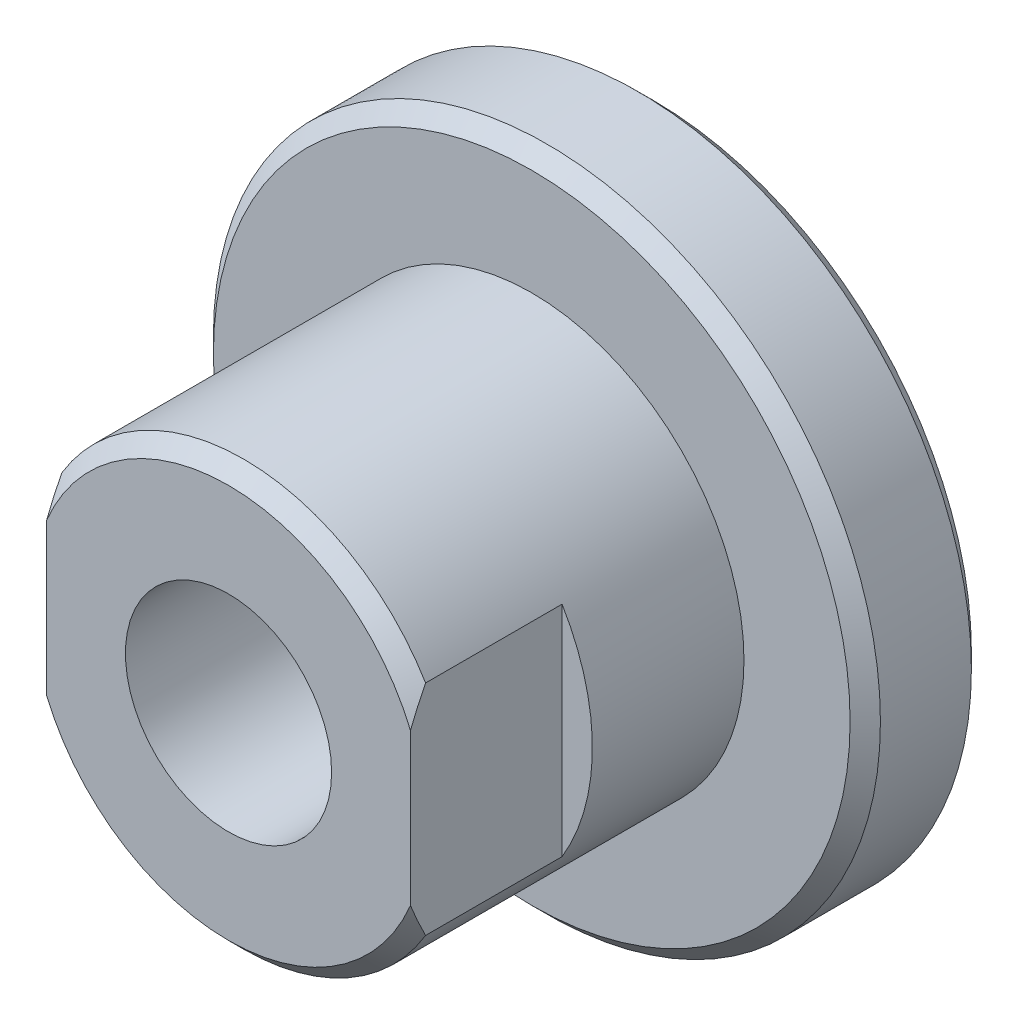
ISO-10303-21;
HEADER;
FILE_DESCRIPTION(('STEP AP214'),'2;1');
FILE_NAME('part.step','',(''),(''),'','','');
FILE_SCHEMA(('AUTOMOTIVE_DESIGN { 1 0 10303 214 1 1 1 1 }'));
ENDSEC;
DATA;
#1=APPLICATION_CONTEXT('core data for automotive mechanical design processes');
#2=APPLICATION_PROTOCOL_DEFINITION('international standard','automotive_design',2000,#1);
#3=PRODUCT_CONTEXT('',#1,'mechanical');
#4=PRODUCT('Part','Part','',(#3));
#5=PRODUCT_RELATED_PRODUCT_CATEGORY('part','',(#4));
#6=PRODUCT_DEFINITION_FORMATION('','',#4);
#7=PRODUCT_DEFINITION_CONTEXT('part definition',#1,'design');
#8=PRODUCT_DEFINITION('design','',#6,#7);
#9=PRODUCT_DEFINITION_SHAPE('','',#8);
#10=(LENGTH_UNIT() NAMED_UNIT(*) SI_UNIT(.MILLI.,.METRE.));
#11=(NAMED_UNIT(*) PLANE_ANGLE_UNIT() SI_UNIT($,.RADIAN.));
#12=(NAMED_UNIT(*) SI_UNIT($,.STERADIAN.) SOLID_ANGLE_UNIT());
#13=UNCERTAINTY_MEASURE_WITH_UNIT(LENGTH_MEASURE(1.E-05),#10,'distance_accuracy_value','');
#14=(GEOMETRIC_REPRESENTATION_CONTEXT(3) GLOBAL_UNCERTAINTY_ASSIGNED_CONTEXT((#13)) GLOBAL_UNIT_ASSIGNED_CONTEXT((#10,
#11,#12)) REPRESENTATION_CONTEXT('',''));
#15=CARTESIAN_POINT('',(0.,0.,0.));
#16=DIRECTION('',(0.,0.,1.));
#17=DIRECTION('',(1.,0.,0.));
#18=AXIS2_PLACEMENT_3D('',#15,#16,#17);
#19=CARTESIAN_POINT('',(0.,0.,14.));
#20=DIRECTION('',(0.,0.,-1.));
#21=DIRECTION('',(-1.,0.,0.));
#22=AXIS2_PLACEMENT_3D('',#19,#20,#21);
#23=CONICAL_SURFACE('',#22,6.5,0.785398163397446);
#24=CARTESIAN_POINT('',(-6.,-14.189120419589,5.09444456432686));
#25=CARTESIAN_POINT('',(-6.,-13.9783762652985,5.28854465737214));
#26=CARTESIAN_POINT('',(-6.,-13.7673091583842,5.48229404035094));
#27=CARTESIAN_POINT('',(-6.,-13.344433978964,5.86898565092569));
#28=CARTESIAN_POINT('',(-6.,-13.1326259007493,6.06192787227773));
#29=CARTESIAN_POINT('',(-6.,-12.4958585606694,6.63946590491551));
#30=CARTESIAN_POINT('',(-6.,-12.0696493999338,7.02268706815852));
#31=CARTESIAN_POINT('',(-6.,-11.2102831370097,7.78656538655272));
#32=CARTESIAN_POINT('',(-6.,-10.7770995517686,8.16719280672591));
#33=CARTESIAN_POINT('',(-6.,-9.90489563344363,8.92161891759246));
#34=CARTESIAN_POINT('',(-6.,-9.46587600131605,9.29541841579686));
#35=CARTESIAN_POINT('',(-6.,-8.66228186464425,9.96457169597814));
#36=CARTESIAN_POINT('',(-6.,-8.29907851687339,10.2615642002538));
#37=CARTESIAN_POINT('',(-6.,-7.74886070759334,10.700373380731));
#38=CARTESIAN_POINT('',(-6.,-7.5645261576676,10.845549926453));
#39=CARTESIAN_POINT('',(-6.,-7.19377345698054,11.133214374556));
#40=CARTESIAN_POINT('',(-6.,-7.00735535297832,11.275702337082));
#41=CARTESIAN_POINT('',(-6.,-6.63228473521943,11.5573006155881));
#42=CARTESIAN_POINT('',(-6.,-6.44363475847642,11.6964143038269));
#43=CARTESIAN_POINT('',(-6.,-6.06350495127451,11.9707110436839));
#44=CARTESIAN_POINT('',(-6.,-5.87202526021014,12.1058942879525));
#45=CARTESIAN_POINT('',(-6.,-5.48581052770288,12.3713809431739));
#46=CARTESIAN_POINT('',(-6.,-5.29107678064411,12.5016862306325));
#47=CARTESIAN_POINT('',(-6.,-4.89772697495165,12.756276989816));
#48=CARTESIAN_POINT('',(-6.,-4.69911136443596,12.8805631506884));
#49=CARTESIAN_POINT('',(-6.,-4.29915222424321,13.1204786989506));
#50=CARTESIAN_POINT('',(-6.,-4.09785008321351,13.2361766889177));
#51=CARTESIAN_POINT('',(-6.,-3.69005957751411,13.4581762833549));
#52=CARTESIAN_POINT('',(-6.,-3.48357065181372,13.5644768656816));
#53=CARTESIAN_POINT('',(-6.,-3.06498745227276,13.7649849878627));
#54=CARTESIAN_POINT('',(-6.,-2.8528986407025,13.859203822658));
#55=CARTESIAN_POINT('',(-6.,-2.42254844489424,14.0323888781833));
#56=CARTESIAN_POINT('',(-6.,-2.20428887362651,14.1113595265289));
#57=CARTESIAN_POINT('',(-6.,-1.80920727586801,14.2353361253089));
#58=CARTESIAN_POINT('',(-6.,-1.63353777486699,14.2839940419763));
#59=CARTESIAN_POINT('',(-6.,-1.27894637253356,14.3676229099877));
#60=CARTESIAN_POINT('',(-6.,-1.10002490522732,14.4025956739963));
#61=CARTESIAN_POINT('',(-6.,-0.740353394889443,14.4570998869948));
#62=CARTESIAN_POINT('',(-6.,-0.559610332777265,14.4766767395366));
#63=CARTESIAN_POINT('',(-6.,-0.197085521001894,14.4994890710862));
#64=CARTESIAN_POINT('',(-6.,-0.0153038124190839,14.5027251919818));
#65=CARTESIAN_POINT('',(-6.,0.348026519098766,14.4926630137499));
#66=CARTESIAN_POINT('',(-6.,0.529574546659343,14.479343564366));
#67=CARTESIAN_POINT('',(-6.,0.890796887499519,14.4368881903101));
#68=CARTESIAN_POINT('',(-6.,1.07047104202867,14.4077509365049));
#69=CARTESIAN_POINT('',(-6.,1.42740071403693,14.3350322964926));
#70=CARTESIAN_POINT('',(-6.,1.60464720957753,14.2914072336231));
#71=CARTESIAN_POINT('',(-6.,1.9555280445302,14.1916103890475));
#72=CARTESIAN_POINT('',(-6.,2.12916232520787,14.1354384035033));
#73=CARTESIAN_POINT('',(-6.,2.50243151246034,14.0017905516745));
#74=CARTESIAN_POINT('',(-6.,2.70134325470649,13.9223089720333));
#75=CARTESIAN_POINT('',(-6.,3.09406710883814,13.7515219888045));
#76=CARTESIAN_POINT('',(-6.,3.28787684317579,13.6602111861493));
#77=CARTESIAN_POINT('',(-6.,3.67106823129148,13.467985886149));
#78=CARTESIAN_POINT('',(-6.,3.86044140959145,13.3670546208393));
#79=CARTESIAN_POINT('',(-6.,4.23490054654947,13.157636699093));
#80=CARTESIAN_POINT('',(-6.,4.41998710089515,13.0491511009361));
#81=CARTESIAN_POINT('',(-6.,4.78863644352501,12.8247540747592));
#82=CARTESIAN_POINT('',(-6.,4.97215428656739,12.7087691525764));
#83=CARTESIAN_POINT('',(-6.,5.33589527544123,12.4717527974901));
#84=CARTESIAN_POINT('',(-6.,5.51611833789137,12.3507212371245));
#85=CARTESIAN_POINT('',(-6.,5.87353199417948,12.1046683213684));
#86=CARTESIAN_POINT('',(-6.,6.05072558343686,11.9796513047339));
#87=CARTESIAN_POINT('',(-6.,6.40266781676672,11.726216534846));
#88=CARTESIAN_POINT('',(-6.,6.57741636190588,11.5977986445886));
#89=CARTESIAN_POINT('',(-6.,7.08615351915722,11.2175520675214));
#90=CARTESIAN_POINT('',(-6.,7.41727857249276,10.9618924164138));
#91=CARTESIAN_POINT('',(-6.,8.07357776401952,10.4430411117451));
#92=CARTESIAN_POINT('',(-6.,8.39875139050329,10.1798488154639));
#93=CARTESIAN_POINT('',(-6.,9.04470289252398,9.64766674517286));
#94=CARTESIAN_POINT('',(-6.,9.36547742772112,9.37867292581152));
#95=CARTESIAN_POINT('',(-6.,10.0033851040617,8.836401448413));
#96=CARTESIAN_POINT('',(-6.,10.3205181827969,8.5631237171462));
#97=CARTESIAN_POINT('',(-6.,10.9366376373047,8.02649703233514));
#98=CARTESIAN_POINT('',(-6.,11.2357612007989,7.76330533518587));
#99=CARTESIAN_POINT('',(-6.,11.8318528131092,7.23448675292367));
#100=CARTESIAN_POINT('',(-6.,12.1288208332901,6.96885983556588));
#101=CARTESIAN_POINT('',(-6.,12.7205312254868,6.43602650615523));
#102=CARTESIAN_POINT('',(-6.,13.0152762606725,6.1688230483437));
#103=CARTESIAN_POINT('',(-6.,13.6032575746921,5.63278070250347));
#104=CARTESIAN_POINT('',(-6.,13.8964939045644,5.36394187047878));
#105=CARTESIAN_POINT('',(-6.,14.189120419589,5.09444456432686));
#106=B_SPLINE_CURVE_WITH_KNOTS('',3,(#24,#25,#26,#27,#28,#29,#30,#31,#32,#33,#34,#35,#36,#37,
#38,#39,#40,#41,#42,#43,#44,#45,#46,#47,#48,#49,#50,#51,#52,#53,#54,#55,#56,#57,#58,#59,#60,#61,
#62,#63,#64,#65,#66,#67,#68,#69,#70,#71,#72,#73,#74,#75,#76,#77,#78,#79,#80,#81,#82,#83,#84,#85,
#86,#87,#88,#89,#90,#91,#92,#93,#94,#95,#96,#97,#98,#99,#100,#101,#102,#103,#104,#105),
.UNSPECIFIED.,.F.,.F.,(4,2,2,2,2,2,2,2,2,2,2,2,2,2,2,2,2,2,2,2,2,2,2,2,2,2,2,2,2,2,2,2,2,2,2,2,
2,2,2,2,4),(0.,0.859529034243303,1.71906470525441,3.43851653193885,5.16841774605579,
6.89811302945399,8.30550929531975,9.00940677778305,9.71328849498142,10.4164350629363,
11.1195471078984,11.8223858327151,12.5251438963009,13.2214938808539,13.9179195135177,
14.6136892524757,15.3092566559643,15.8556421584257,16.4019552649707,16.9466511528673,
17.491325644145,18.0366966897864,18.5821135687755,19.129189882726,19.6762750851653,
20.3183990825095,20.960817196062,21.6043762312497,22.2478452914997,22.8990367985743,
23.5502447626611,24.2007664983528,24.8513144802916,26.106152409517,27.3610977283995,
28.6169483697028,29.872820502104,31.0680882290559,32.2633718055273,33.4568688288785,
34.6503252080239),.UNSPECIFIED.);
#107=CARTESIAN_POINT('',(-6.,-3.60555127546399,13.5));
#108=VERTEX_POINT('',#107);
#109=CARTESIAN_POINT('',(-6.,-2.5,14.));
#110=VERTEX_POINT('',#109);
#111=EDGE_CURVE('E39',#108,#110,#106,.T.);
#112=ORIENTED_EDGE('',*,*,#111,.F.);
#113=CARTESIAN_POINT('',(0.,0.,13.5));
#114=DIRECTION('',(0.,0.,1.));
#115=DIRECTION('',(1.,0.,0.));
#116=AXIS2_PLACEMENT_3D('',#113,#114,#115);
#117=CIRCLE('',#116,7.);
#118=CARTESIAN_POINT('',(6.,-3.60555127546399,13.5));
#119=VERTEX_POINT('',#118);
#120=EDGE_CURVE('E108',#119,#108,#117,.F.);
#121=ORIENTED_EDGE('',*,*,#120,.F.);
#122=CARTESIAN_POINT('',(6.,14.189120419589,5.09444456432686));
#123=CARTESIAN_POINT('',(6.,13.9783762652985,5.28854465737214));
#124=CARTESIAN_POINT('',(6.,13.7673091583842,5.48229404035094));
#125=CARTESIAN_POINT('',(6.,13.344433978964,5.86898565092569));
#126=CARTESIAN_POINT('',(6.,13.1326259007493,6.06192787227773));
#127=CARTESIAN_POINT('',(6.,12.4958585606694,6.63946590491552));
#128=CARTESIAN_POINT('',(6.,12.0696493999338,7.02268706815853));
#129=CARTESIAN_POINT('',(6.,11.2102831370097,7.78656538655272));
#130=CARTESIAN_POINT('',(6.,10.7770995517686,8.16719280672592));
#131=CARTESIAN_POINT('',(6.,9.90489563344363,8.92161891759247));
#132=CARTESIAN_POINT('',(6.,9.46587600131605,9.29541841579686));
#133=CARTESIAN_POINT('',(6.,8.66228186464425,9.96457169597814));
#134=CARTESIAN_POINT('',(6.,8.29907851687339,10.2615642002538));
#135=CARTESIAN_POINT('',(6.,7.74886070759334,10.700373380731));
#136=CARTESIAN_POINT('',(6.,7.5645261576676,10.845549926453));
#137=CARTESIAN_POINT('',(6.,7.19377345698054,11.133214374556));
#138=CARTESIAN_POINT('',(6.,7.00735535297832,11.2757023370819));
#139=CARTESIAN_POINT('',(6.,6.63228473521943,11.5573006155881));
#140=CARTESIAN_POINT('',(6.,6.44363475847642,11.6964143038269));
#141=CARTESIAN_POINT('',(6.,6.06350495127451,11.9707110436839));
#142=CARTESIAN_POINT('',(6.,5.87202526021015,12.1058942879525));
#143=CARTESIAN_POINT('',(6.,5.48581052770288,12.3713809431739));
#144=CARTESIAN_POINT('',(6.,5.29107678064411,12.5016862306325));
#145=CARTESIAN_POINT('',(6.,4.89772697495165,12.756276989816));
#146=CARTESIAN_POINT('',(6.,4.69911136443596,12.8805631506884));
#147=CARTESIAN_POINT('',(6.,4.29915222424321,13.1204786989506));
#148=CARTESIAN_POINT('',(6.,4.09785008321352,13.2361766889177));
#149=CARTESIAN_POINT('',(6.,3.69005957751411,13.4581762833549));
#150=CARTESIAN_POINT('',(6.,3.48357065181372,13.5644768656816));
#151=CARTESIAN_POINT('',(6.,3.06498745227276,13.7649849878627));
#152=CARTESIAN_POINT('',(6.,2.85289864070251,13.859203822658));
#153=CARTESIAN_POINT('',(6.,2.42254844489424,14.0323888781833));
#154=CARTESIAN_POINT('',(6.,2.20428887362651,14.1113595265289));
#155=CARTESIAN_POINT('',(6.,1.80920727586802,14.2353361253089));
#156=CARTESIAN_POINT('',(6.,1.63353777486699,14.2839940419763));
#157=CARTESIAN_POINT('',(6.,1.27894637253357,14.3676229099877));
#158=CARTESIAN_POINT('',(6.,1.10002490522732,14.4025956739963));
#159=CARTESIAN_POINT('',(6.,0.740353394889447,14.4570998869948));
#160=CARTESIAN_POINT('',(6.,0.559610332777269,14.4766767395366));
#161=CARTESIAN_POINT('',(6.,0.197085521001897,14.4994890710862));
#162=CARTESIAN_POINT('',(6.,0.0153038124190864,14.5027251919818));
#163=CARTESIAN_POINT('',(6.,-0.348026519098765,14.4926630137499));
#164=CARTESIAN_POINT('',(6.,-0.529574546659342,14.4793435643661));
#165=CARTESIAN_POINT('',(6.,-0.890796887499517,14.4368881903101));
#166=CARTESIAN_POINT('',(6.,-1.07047104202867,14.4077509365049));
#167=CARTESIAN_POINT('',(6.,-1.42740071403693,14.3350322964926));
#168=CARTESIAN_POINT('',(6.,-1.60464720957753,14.2914072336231));
#169=CARTESIAN_POINT('',(6.,-1.9555280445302,14.1916103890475));
#170=CARTESIAN_POINT('',(6.,-2.12916232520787,14.1354384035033));
#171=CARTESIAN_POINT('',(6.,-2.50243151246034,14.0017905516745));
#172=CARTESIAN_POINT('',(6.,-2.70134325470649,13.9223089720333));
#173=CARTESIAN_POINT('',(6.,-3.09406710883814,13.7515219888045));
#174=CARTESIAN_POINT('',(6.,-3.28787684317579,13.6602111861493));
#175=CARTESIAN_POINT('',(6.,-3.67106823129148,13.467985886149));
#176=CARTESIAN_POINT('',(6.,-3.86044140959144,13.3670546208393));
#177=CARTESIAN_POINT('',(6.,-4.23490054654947,13.157636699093));
#178=CARTESIAN_POINT('',(6.,-4.41998710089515,13.0491511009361));
#179=CARTESIAN_POINT('',(6.,-4.788636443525,12.8247540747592));
#180=CARTESIAN_POINT('',(6.,-4.97215428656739,12.7087691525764));
#181=CARTESIAN_POINT('',(6.,-5.33589527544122,12.4717527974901));
#182=CARTESIAN_POINT('',(6.,-5.51611833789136,12.3507212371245));
#183=CARTESIAN_POINT('',(6.,-5.87353199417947,12.1046683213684));
#184=CARTESIAN_POINT('',(6.,-6.05072558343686,11.9796513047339));
#185=CARTESIAN_POINT('',(6.,-6.40266781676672,11.7262165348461));
#186=CARTESIAN_POINT('',(6.,-6.57741636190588,11.5977986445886));
#187=CARTESIAN_POINT('',(6.,-7.08615351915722,11.2175520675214));
#188=CARTESIAN_POINT('',(6.,-7.41727857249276,10.9618924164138));
#189=CARTESIAN_POINT('',(6.,-8.07357776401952,10.4430411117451));
#190=CARTESIAN_POINT('',(6.,-8.39875139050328,10.1798488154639));
#191=CARTESIAN_POINT('',(6.,-9.04470289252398,9.64766674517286));
#192=CARTESIAN_POINT('',(6.,-9.36547742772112,9.37867292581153));
#193=CARTESIAN_POINT('',(6.,-10.0033851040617,8.83640144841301));
#194=CARTESIAN_POINT('',(6.,-10.3205181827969,8.5631237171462));
#195=CARTESIAN_POINT('',(6.,-10.9366376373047,8.02649703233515));
#196=CARTESIAN_POINT('',(6.,-11.2357612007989,7.76330533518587));
#197=CARTESIAN_POINT('',(6.,-11.8318528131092,7.23448675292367));
#198=CARTESIAN_POINT('',(6.,-12.1288208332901,6.96885983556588));
#199=CARTESIAN_POINT('',(6.,-12.7205312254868,6.43602650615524));
#200=CARTESIAN_POINT('',(6.,-13.0152762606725,6.1688230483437));
#201=CARTESIAN_POINT('',(6.,-13.6032575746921,5.63278070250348));
#202=CARTESIAN_POINT('',(6.,-13.8964939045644,5.36394187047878));
#203=CARTESIAN_POINT('',(6.,-14.189120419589,5.09444456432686));
#204=B_SPLINE_CURVE_WITH_KNOTS('',3,(#122,#123,#124,#125,#126,#127,#128,#129,#130,#131,#132,
#133,#134,#135,#136,#137,#138,#139,#140,#141,#142,#143,#144,#145,#146,#147,#148,#149,#150,#151,
#152,#153,#154,#155,#156,#157,#158,#159,#160,#161,#162,#163,#164,#165,#166,#167,#168,#169,#170,
#171,#172,#173,#174,#175,#176,#177,#178,#179,#180,#181,#182,#183,#184,#185,#186,#187,#188,#189,
#190,#191,#192,#193,#194,#195,#196,#197,#198,#199,#200,#201,#202,#203),.UNSPECIFIED.,.F.,.F.,(4,
2,2,2,2,2,2,2,2,2,2,2,2,2,2,2,2,2,2,2,2,2,2,2,2,2,2,2,2,2,2,2,2,2,2,2,2,2,2,2,4),(0.,
0.859529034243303,1.71906470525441,3.43851653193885,5.16841774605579,6.89811302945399,
8.30550929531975,9.00940677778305,9.71328849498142,10.4164350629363,11.1195471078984,
11.8223858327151,12.5251438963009,13.2214938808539,13.9179195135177,14.6136892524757,
15.3092566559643,15.8556421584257,16.4019552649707,16.9466511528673,17.491325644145,
18.0366966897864,18.5821135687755,19.129189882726,19.6762750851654,20.3183990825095,
20.960817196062,21.6043762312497,22.2478452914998,22.8990367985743,23.5502447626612,
24.2007664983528,24.8513144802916,26.106152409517,27.3610977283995,28.6169483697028,
29.872820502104,31.0680882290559,32.2633718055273,33.4568688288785,34.6503252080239),.UNSPECIFIED.);
#205=CARTESIAN_POINT('',(6.,-2.5,14.));
#206=VERTEX_POINT('',#205);
#207=EDGE_CURVE('E99',#206,#119,#204,.T.);
#208=ORIENTED_EDGE('',*,*,#207,.F.);
#209=CARTESIAN_POINT('',(0.,0.,14.));
#210=DIRECTION('',(0.,0.,1.));
#211=DIRECTION('',(1.,0.,0.));
#212=AXIS2_PLACEMENT_3D('',#209,#210,#211);
#213=CIRCLE('',#212,6.5);
#214=EDGE_CURVE('E53',#110,#206,#213,.T.);
#215=ORIENTED_EDGE('',*,*,#214,.F.);
#216=EDGE_LOOP('',(#112,#121,#208,#215));
#217=FACE_BOUND('',#216,.T.);
#218=ADVANCED_FACE('F31',(#217),#23,.T.);
#219=CARTESIAN_POINT('',(0.,0.,4.));
#220=DIRECTION('',(0.,0.,1.));
#221=DIRECTION('',(1.,0.,0.));
#222=AXIS2_PLACEMENT_3D('',#219,#220,#221);
#223=PLANE('',#222);
#224=CARTESIAN_POINT('',(0.,0.,4.));
#225=DIRECTION('',(0.,0.,1.));
#226=DIRECTION('',(1.,0.,0.));
#227=AXIS2_PLACEMENT_3D('',#224,#225,#226);
#228=CIRCLE('',#227,10.5);
#229=CARTESIAN_POINT('',(10.5,0.,4.));
#230=VERTEX_POINT('',#229);
#231=EDGE_CURVE('E100',#230,#230,#228,.T.);
#232=ORIENTED_EDGE('',*,*,#231,.T.);
#233=EDGE_LOOP('',(#232));
#234=FACE_BOUND('',#233,.T.);
#235=CARTESIAN_POINT('',(0.,0.,4.));
#236=DIRECTION('',(0.,0.,1.));
#237=DIRECTION('',(1.,0.,0.));
#238=AXIS2_PLACEMENT_3D('',#235,#236,#237);
#239=CIRCLE('',#238,7.);
#240=CARTESIAN_POINT('',(7.,0.,4.));
#241=VERTEX_POINT('',#240);
#242=EDGE_CURVE('E166',#241,#241,#239,.T.);
#243=ORIENTED_EDGE('',*,*,#242,.F.);
#244=EDGE_LOOP('',(#243));
#245=FACE_BOUND('',#244,.T.);
#246=ADVANCED_FACE('F188',(#234,#245),#223,.T.);
#247=CARTESIAN_POINT('',(0.,0.,4.));
#248=DIRECTION('',(0.,0.,-1.));
#249=DIRECTION('',(-1.,0.,0.));
#250=AXIS2_PLACEMENT_3D('',#247,#248,#249);
#251=CYLINDRICAL_SURFACE('',#250,11.);
#252=CARTESIAN_POINT('',(0.,0.,0.500000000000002));
#253=DIRECTION('',(0.,0.,1.));
#254=DIRECTION('',(1.,0.,0.));
#255=AXIS2_PLACEMENT_3D('',#252,#253,#254);
#256=CIRCLE('',#255,11.);
#257=CARTESIAN_POINT('',(11.,0.,0.500000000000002));
#258=VERTEX_POINT('',#257);
#259=EDGE_CURVE('E172',#258,#258,#256,.T.);
#260=ORIENTED_EDGE('',*,*,#259,.T.);
#261=EDGE_LOOP('',(#260));
#262=FACE_BOUND('',#261,.T.);
#263=CARTESIAN_POINT('',(0.,0.,3.5));
#264=DIRECTION('',(0.,0.,1.));
#265=DIRECTION('',(1.,0.,0.));
#266=AXIS2_PLACEMENT_3D('',#263,#264,#265);
#267=CIRCLE('',#266,11.);
#268=CARTESIAN_POINT('',(11.,0.,3.5));
#269=VERTEX_POINT('',#268);
#270=EDGE_CURVE('E169',#269,#269,#267,.F.);
#271=ORIENTED_EDGE('',*,*,#270,.T.);
#272=EDGE_LOOP('',(#271));
#273=FACE_BOUND('',#272,.T.);
#274=ADVANCED_FACE('F33',(#262,#273),#251,.T.);
#275=CARTESIAN_POINT('',(0.,0.,0.));
#276=DIRECTION('',(0.,0.,1.));
#277=DIRECTION('',(1.,0.,0.));
#278=AXIS2_PLACEMENT_3D('',#275,#276,#277);
#279=PLANE('',#278);
#280=CARTESIAN_POINT('',(0.,0.,0.));
#281=DIRECTION('',(0.,0.,1.));
#282=DIRECTION('',(1.,0.,0.));
#283=AXIS2_PLACEMENT_3D('',#280,#281,#282);
#284=CIRCLE('',#283,3.4);
#285=CARTESIAN_POINT('',(3.4,0.,0.));
#286=VERTEX_POINT('',#285);
#287=EDGE_CURVE('E299',#286,#286,#284,.T.);
#288=ORIENTED_EDGE('',*,*,#287,.T.);
#289=EDGE_LOOP('',(#288));
#290=FACE_BOUND('',#289,.T.);
#291=CARTESIAN_POINT('',(0.,0.,0.));
#292=DIRECTION('',(0.,0.,1.));
#293=DIRECTION('',(1.,0.,0.));
#294=AXIS2_PLACEMENT_3D('',#291,#292,#293);
#295=CIRCLE('',#294,10.5);
#296=CARTESIAN_POINT('',(10.5,0.,0.));
#297=VERTEX_POINT('',#296);
#298=EDGE_CURVE('E104',#297,#297,#295,.F.);
#299=ORIENTED_EDGE('',*,*,#298,.T.);
#300=EDGE_LOOP('',(#299));
#301=FACE_BOUND('',#300,.T.);
#302=ADVANCED_FACE('F177',(#290,#301),#279,.F.);
#303=CARTESIAN_POINT('',(0.,0.,14.));
#304=DIRECTION('',(0.,0.,-1.));
#305=DIRECTION('',(-1.,0.,0.));
#306=AXIS2_PLACEMENT_3D('',#303,#304,#305);
#307=CYLINDRICAL_SURFACE('',#306,7.);
#308=ORIENTED_EDGE('',*,*,#120,.T.);
#309=DIRECTION('',(0.,0.,-1.));
#310=VECTOR('',#309,1.);
#311=CARTESIAN_POINT('',(-6.,-3.60555127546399,14.));
#312=LINE('',#311,#310);
#313=CARTESIAN_POINT('',(-6.,-3.60555127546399,9.));
#314=VERTEX_POINT('',#313);
#315=EDGE_CURVE('E86',#108,#314,#312,.T.);
#316=ORIENTED_EDGE('',*,*,#315,.T.);
#317=CARTESIAN_POINT('',(0.,0.,9.));
#318=DIRECTION('',(0.,0.,-1.));
#319=DIRECTION('',(-1.,0.,0.));
#320=AXIS2_PLACEMENT_3D('',#317,#318,#319);
#321=CIRCLE('',#320,7.);
#322=CARTESIAN_POINT('',(-6.,3.60555127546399,9.));
#323=VERTEX_POINT('',#322);
#324=EDGE_CURVE('E11',#314,#323,#321,.T.);
#325=ORIENTED_EDGE('',*,*,#324,.T.);
#326=DIRECTION('',(0.,0.,-1.));
#327=VECTOR('',#326,1.);
#328=CARTESIAN_POINT('',(-6.,3.60555127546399,14.));
#329=LINE('',#328,#327);
#330=CARTESIAN_POINT('',(-6.,3.60555127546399,13.5));
#331=VERTEX_POINT('',#330);
#332=EDGE_CURVE('E155',#323,#331,#329,.F.);
#333=ORIENTED_EDGE('',*,*,#332,.T.);
#334=CARTESIAN_POINT('',(6.,3.60555127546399,13.5));
#335=VERTEX_POINT('',#334);
#336=EDGE_CURVE('E102',#331,#335,#117,.F.);
#337=ORIENTED_EDGE('',*,*,#336,.T.);
#338=DIRECTION('',(0.,0.,-1.));
#339=VECTOR('',#338,1.);
#340=CARTESIAN_POINT('',(6.,3.60555127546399,14.));
#341=LINE('',#340,#339);
#342=CARTESIAN_POINT('',(6.,3.60555127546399,9.));
#343=VERTEX_POINT('',#342);
#344=EDGE_CURVE('E147',#335,#343,#341,.T.);
#345=ORIENTED_EDGE('',*,*,#344,.T.);
#346=CARTESIAN_POINT('',(0.,0.,9.));
#347=DIRECTION('',(0.,0.,1.));
#348=DIRECTION('',(1.,0.,0.));
#349=AXIS2_PLACEMENT_3D('',#346,#347,#348);
#350=CIRCLE('',#349,7.);
#351=CARTESIAN_POINT('',(6.,-3.60555127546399,9.));
#352=VERTEX_POINT('',#351);
#353=EDGE_CURVE('E117',#352,#343,#350,.T.);
#354=ORIENTED_EDGE('',*,*,#353,.F.);
#355=DIRECTION('',(0.,0.,-1.));
#356=VECTOR('',#355,1.);
#357=CARTESIAN_POINT('',(6.,-3.60555127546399,14.));
#358=LINE('',#357,#356);
#359=EDGE_CURVE('E162',#352,#119,#358,.F.);
#360=ORIENTED_EDGE('',*,*,#359,.T.);
#361=EDGE_LOOP('',(#308,#316,#325,#333,#337,#345,#354,#360));
#362=FACE_BOUND('',#361,.T.);
#363=ORIENTED_EDGE('',*,*,#242,.T.);
#364=EDGE_LOOP('',(#363));
#365=FACE_BOUND('',#364,.T.);
#366=ADVANCED_FACE('F153',(#362,#365),#307,.T.);
#367=CARTESIAN_POINT('',(0.,0.,14.));
#368=DIRECTION('',(0.,0.,1.));
#369=DIRECTION('',(1.,0.,0.));
#370=AXIS2_PLACEMENT_3D('',#367,#368,#369);
#371=PLANE('',#370);
#372=CARTESIAN_POINT('',(0.,0.,14.));
#373=DIRECTION('',(0.,0.,1.));
#374=DIRECTION('',(1.,0.,0.));
#375=AXIS2_PLACEMENT_3D('',#372,#373,#374);
#376=CIRCLE('',#375,3.4);
#377=CARTESIAN_POINT('',(3.4,0.,14.));
#378=VERTEX_POINT('',#377);
#379=EDGE_CURVE('E96',#378,#378,#376,.T.);
#380=ORIENTED_EDGE('',*,*,#379,.F.);
#381=EDGE_LOOP('',(#380));
#382=FACE_BOUND('',#381,.T.);
#383=DIRECTION('',(0.,1.,0.));
#384=VECTOR('',#383,1.);
#385=CARTESIAN_POINT('',(-6.,13.8098106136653,14.));
#386=LINE('',#385,#384);
#387=CARTESIAN_POINT('',(-6.,2.5,14.));
#388=VERTEX_POINT('',#387);
#389=EDGE_CURVE('E46',#110,#388,#386,.T.);
#390=ORIENTED_EDGE('',*,*,#389,.F.);
#391=ORIENTED_EDGE('',*,*,#214,.T.);
#392=DIRECTION('',(0.,-1.,0.));
#393=VECTOR('',#392,1.);
#394=CARTESIAN_POINT('',(6.,11.2333534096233,14.));
#395=LINE('',#394,#393);
#396=CARTESIAN_POINT('',(6.,2.5,14.));
#397=VERTEX_POINT('',#396);
#398=EDGE_CURVE('E145',#397,#206,#395,.T.);
#399=ORIENTED_EDGE('',*,*,#398,.F.);
#400=EDGE_CURVE('E94',#397,#388,#213,.T.);
#401=ORIENTED_EDGE('',*,*,#400,.T.);
#402=EDGE_LOOP('',(#390,#391,#399,#401));
#403=FACE_BOUND('',#402,.T.);
#404=ADVANCED_FACE('F92',(#382,#403),#371,.T.);
#405=CARTESIAN_POINT('',(0.,0.,0.500000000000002));
#406=DIRECTION('',(0.,0.,1.));
#407=DIRECTION('',(1.,0.,0.));
#408=AXIS2_PLACEMENT_3D('',#405,#406,#407);
#409=CONICAL_SURFACE('',#408,11.,0.78539816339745);
#410=ORIENTED_EDGE('',*,*,#298,.F.);
#411=EDGE_LOOP('',(#410));
#412=FACE_BOUND('',#411,.T.);
#413=ORIENTED_EDGE('',*,*,#259,.F.);
#414=EDGE_LOOP('',(#413));
#415=FACE_BOUND('',#414,.T.);
#416=ADVANCED_FACE('F179',(#412,#415),#409,.T.);
#417=CARTESIAN_POINT('',(0.,0.,4.));
#418=DIRECTION('',(0.,0.,-1.));
#419=DIRECTION('',(-1.,0.,0.));
#420=AXIS2_PLACEMENT_3D('',#417,#418,#419);
#421=CONICAL_SURFACE('',#420,10.5,0.785398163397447);
#422=ORIENTED_EDGE('',*,*,#270,.F.);
#423=EDGE_LOOP('',(#422));
#424=FACE_BOUND('',#423,.T.);
#425=ORIENTED_EDGE('',*,*,#231,.F.);
#426=EDGE_LOOP('',(#425));
#427=FACE_BOUND('',#426,.T.);
#428=ADVANCED_FACE('F182',(#424,#427),#421,.T.);
#429=EDGE_CURVE('E90',#388,#331,#106,.T.);
#430=ORIENTED_EDGE('',*,*,#429,.F.);
#431=ORIENTED_EDGE('',*,*,#400,.F.);
#432=EDGE_CURVE('E116',#335,#397,#204,.T.);
#433=ORIENTED_EDGE('',*,*,#432,.F.);
#434=ORIENTED_EDGE('',*,*,#336,.F.);
#435=EDGE_LOOP('',(#430,#431,#433,#434));
#436=FACE_BOUND('',#435,.T.);
#437=ADVANCED_FACE('F118',(#436),#23,.T.);
#438=CARTESIAN_POINT('',(6.,-10.6150036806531,9.));
#439=DIRECTION('',(0.,0.,1.));
#440=DIRECTION('',(1.,0.,0.));
#441=AXIS2_PLACEMENT_3D('',#438,#439,#440);
#442=PLANE('',#441);
#443=ORIENTED_EDGE('',*,*,#353,.T.);
#444=DIRECTION('',(0.,-1.,0.));
#445=VECTOR('',#444,1.);
#446=CARTESIAN_POINT('',(6.,11.2333534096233,9.));
#447=LINE('',#446,#445);
#448=EDGE_CURVE('E150',#343,#352,#447,.T.);
#449=ORIENTED_EDGE('',*,*,#448,.T.);
#450=EDGE_LOOP('',(#443,#449));
#451=FACE_BOUND('',#450,.T.);
#452=ADVANCED_FACE('F126',(#451),#442,.T.);
#453=CARTESIAN_POINT('',(6.,11.2333534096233,9.));
#454=DIRECTION('',(-1.,0.,0.));
#455=DIRECTION('',(0.,-1.,0.));
#456=AXIS2_PLACEMENT_3D('',#453,#454,#455);
#457=PLANE('',#456);
#458=ORIENTED_EDGE('',*,*,#432,.T.);
#459=ORIENTED_EDGE('',*,*,#398,.T.);
#460=ORIENTED_EDGE('',*,*,#207,.T.);
#461=ORIENTED_EDGE('',*,*,#359,.F.);
#462=ORIENTED_EDGE('',*,*,#448,.F.);
#463=ORIENTED_EDGE('',*,*,#344,.F.);
#464=EDGE_LOOP('',(#458,#459,#460,#461,#462,#463));
#465=FACE_BOUND('',#464,.T.);
#466=ADVANCED_FACE('F121',(#465),#457,.F.);
#467=CARTESIAN_POINT('',(-6.,-10.6150036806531,9.));
#468=DIRECTION('',(0.,0.,-1.));
#469=DIRECTION('',(-1.,0.,0.));
#470=AXIS2_PLACEMENT_3D('',#467,#468,#469);
#471=PLANE('',#470);
#472=DIRECTION('',(0.,1.,0.));
#473=VECTOR('',#472,1.);
#474=CARTESIAN_POINT('',(-6.,13.8098106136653,9.));
#475=LINE('',#474,#473);
#476=EDGE_CURVE('E95',#314,#323,#475,.T.);
#477=ORIENTED_EDGE('',*,*,#476,.T.);
#478=ORIENTED_EDGE('',*,*,#324,.F.);
#479=EDGE_LOOP('',(#477,#478));
#480=FACE_BOUND('',#479,.T.);
#481=ADVANCED_FACE('F125',(#480),#471,.F.);
#482=CARTESIAN_POINT('',(-6.,13.8098106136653,9.));
#483=DIRECTION('',(1.,0.,0.));
#484=DIRECTION('',(0.,1.,0.));
#485=AXIS2_PLACEMENT_3D('',#482,#483,#484);
#486=PLANE('',#485);
#487=ORIENTED_EDGE('',*,*,#111,.T.);
#488=ORIENTED_EDGE('',*,*,#389,.T.);
#489=ORIENTED_EDGE('',*,*,#429,.T.);
#490=ORIENTED_EDGE('',*,*,#332,.F.);
#491=ORIENTED_EDGE('',*,*,#476,.F.);
#492=ORIENTED_EDGE('',*,*,#315,.F.);
#493=EDGE_LOOP('',(#487,#488,#489,#490,#491,#492));
#494=FACE_BOUND('',#493,.T.);
#495=ADVANCED_FACE('F83',(#494),#486,.F.);
#496=CARTESIAN_POINT('',(0.,0.,14.));
#497=DIRECTION('',(0.,0.,1.));
#498=DIRECTION('',(1.,0.,0.));
#499=AXIS2_PLACEMENT_3D('',#496,#497,#498);
#500=CYLINDRICAL_SURFACE('',#499,3.4);
#501=ORIENTED_EDGE('',*,*,#287,.F.);
#502=EDGE_LOOP('',(#501));
#503=FACE_BOUND('',#502,.T.);
#504=ORIENTED_EDGE('',*,*,#379,.T.);
#505=EDGE_LOOP('',(#504));
#506=FACE_BOUND('',#505,.T.);
#507=ADVANCED_FACE('F134',(#503,#506),#500,.F.);
#508=CLOSED_SHELL('',(#218,#246,#274,#302,#366,#404,#416,#428,#437,#452,#466,#481,#495,#507));
#509=MANIFOLD_SOLID_BREP('B2',#508);
#510=ADVANCED_BREP_SHAPE_REPRESENTATION('',(#18,#509),#14);
#511=SHAPE_DEFINITION_REPRESENTATION(#9,#510);
ENDSEC;
END-ISO-10303-21;
